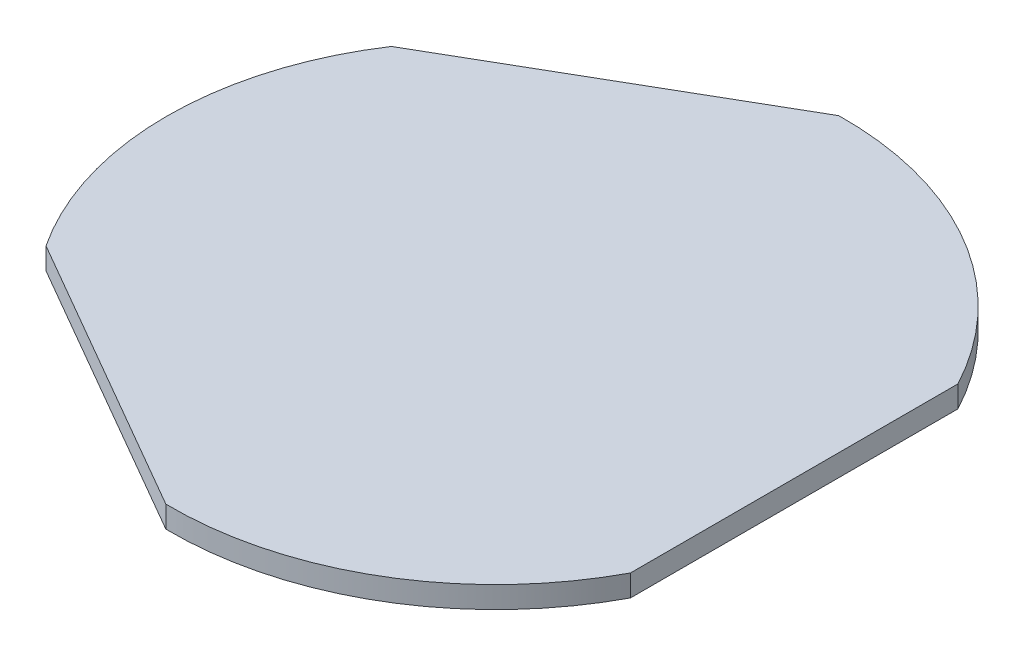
from build123d import *

# Parameters (mm, degrees)
EXTRUDE_1_DEPTH = 0.9


with BuildPart() as part:
    # Sketch 1 → Extrude 1 (new body)
    with BuildSketch(Plane(origin=(0, -17.350605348, 0), x_dir=(1, 0, 0), z_dir=(0, 1, 0))):
        with BuildLine():
            Line((-19.314345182, 13.972958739), (-31.092290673, 7.172958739))
            ThreePointArc((-31.092290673, 7.172958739), (-33.250304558, 0), (-31.092290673, -7.172958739))
            Line((-31.092290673, -7.172958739), (-19.314345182, -13.972958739))
            ThreePointArc((-19.314345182, -13.972958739), (-12.243076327, -12.092998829), (-7.191219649, -6.8))
            Line((-7.191219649, -6.8), (-7.191219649, 6.8))
            ThreePointArc((-7.191219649, 6.8), (-12.243076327, 12.092998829), (-19.314345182, 13.972958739))
        make_face()
    extrude(amount=EXTRUDE_1_DEPTH)


solid = part.part
